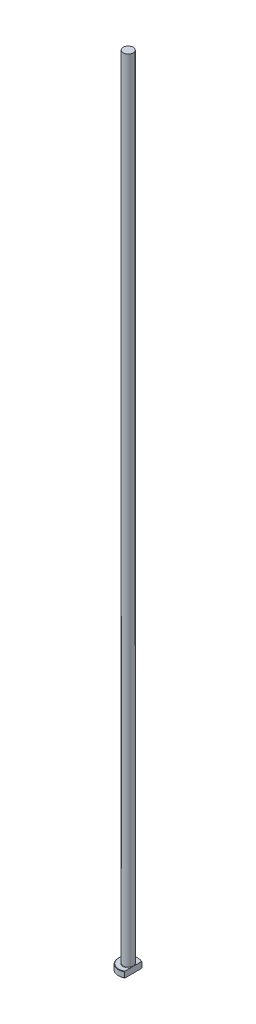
ISO-10303-21;
HEADER;
FILE_DESCRIPTION(('STEP AP214'),'2;1');
FILE_NAME('part.step','',(''),(''),'','','');
FILE_SCHEMA(('AUTOMOTIVE_DESIGN { 1 0 10303 214 1 1 1 1 }'));
ENDSEC;
DATA;
#1=APPLICATION_CONTEXT('core data for automotive mechanical design processes');
#2=APPLICATION_PROTOCOL_DEFINITION('international standard','automotive_design',2000,#1);
#3=PRODUCT_CONTEXT('',#1,'mechanical');
#4=PRODUCT('Part','Part','',(#3));
#5=PRODUCT_RELATED_PRODUCT_CATEGORY('part','',(#4));
#6=PRODUCT_DEFINITION_FORMATION('','',#4);
#7=PRODUCT_DEFINITION_CONTEXT('part definition',#1,'design');
#8=PRODUCT_DEFINITION('design','',#6,#7);
#9=PRODUCT_DEFINITION_SHAPE('','',#8);
#10=(LENGTH_UNIT() NAMED_UNIT(*) SI_UNIT(.MILLI.,.METRE.));
#11=(NAMED_UNIT(*) PLANE_ANGLE_UNIT() SI_UNIT($,.RADIAN.));
#12=(NAMED_UNIT(*) SI_UNIT($,.STERADIAN.) SOLID_ANGLE_UNIT());
#13=UNCERTAINTY_MEASURE_WITH_UNIT(LENGTH_MEASURE(1.E-05),#10,'distance_accuracy_value','');
#14=(GEOMETRIC_REPRESENTATION_CONTEXT(3) GLOBAL_UNCERTAINTY_ASSIGNED_CONTEXT((#13)) GLOBAL_UNIT_ASSIGNED_CONTEXT((#10,
#11,#12)) REPRESENTATION_CONTEXT('',''));
#15=CARTESIAN_POINT('',(0.,0.,0.));
#16=DIRECTION('',(0.,0.,1.));
#17=DIRECTION('',(1.,0.,0.));
#18=AXIS2_PLACEMENT_3D('',#15,#16,#17);
#19=CARTESIAN_POINT('',(0.,0.,0.));
#20=DIRECTION('',(0.,-1.,0.));
#21=DIRECTION('',(0.,0.,-1.));
#22=AXIS2_PLACEMENT_3D('',#19,#20,#21);
#23=PLANE('',#22);
#24=CARTESIAN_POINT('',(0.,0.,0.));
#25=DIRECTION('',(0.,-1.,0.));
#26=DIRECTION('',(0.,0.,-1.));
#27=AXIS2_PLACEMENT_3D('',#24,#25,#26);
#28=CIRCLE('',#27,4.79999999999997);
#29=CARTESIAN_POINT('',(2.49999999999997,0.,4.09756024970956));
#30=VERTEX_POINT('',#29);
#31=CARTESIAN_POINT('',(2.49999999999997,0.,-4.09756024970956));
#32=VERTEX_POINT('',#31);
#33=EDGE_CURVE('E98',#30,#32,#28,.T.);
#34=ORIENTED_EDGE('',*,*,#33,.T.);
#35=DIRECTION('',(0.,0.,1.));
#36=VECTOR('',#35,1.);
#37=CARTESIAN_POINT('',(2.49999999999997,0.,-4.33012701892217));
#38=LINE('',#37,#36);
#39=EDGE_CURVE('E83',#32,#30,#38,.T.);
#40=ORIENTED_EDGE('',*,*,#39,.T.);
#41=EDGE_LOOP('',(#34,#40));
#42=FACE_BOUND('',#41,.T.);
#43=ADVANCED_FACE('F32',(#42),#23,.T.);
#44=CARTESIAN_POINT('',(0.,259.958771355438,0.));
#45=DIRECTION('',(0.,1.,0.));
#46=DIRECTION('',(0.,0.,1.));
#47=AXIS2_PLACEMENT_3D('',#44,#45,#46);
#48=CYLINDRICAL_SURFACE('',#47,4.99999999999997);
#49=CARTESIAN_POINT('',(0.,2.80000000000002,0.));
#50=DIRECTION('',(0.,1.,0.));
#51=DIRECTION('',(0.,0.,1.));
#52=AXIS2_PLACEMENT_3D('',#49,#50,#51);
#53=CIRCLE('',#52,4.99999999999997);
#54=CARTESIAN_POINT('',(2.49999999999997,2.80000000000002,4.33012701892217));
#55=VERTEX_POINT('',#54);
#56=CARTESIAN_POINT('',(2.49999999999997,2.80000000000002,-4.33012701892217));
#57=VERTEX_POINT('',#56);
#58=EDGE_CURVE('E104',#55,#57,#53,.F.);
#59=ORIENTED_EDGE('',*,*,#58,.T.);
#60=DIRECTION('',(0.,-1.,0.));
#61=VECTOR('',#60,1.);
#62=CARTESIAN_POINT('',(2.49999999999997,400.,-4.33012701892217));
#63=LINE('',#62,#61);
#64=CARTESIAN_POINT('',(2.49999999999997,0.199999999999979,-4.33012701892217));
#65=VERTEX_POINT('',#64);
#66=EDGE_CURVE('E183',#57,#65,#63,.T.);
#67=ORIENTED_EDGE('',*,*,#66,.T.);
#68=CARTESIAN_POINT('',(0.,0.199999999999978,0.));
#69=DIRECTION('',(0.,-1.,0.));
#70=DIRECTION('',(0.,0.,-1.));
#71=AXIS2_PLACEMENT_3D('',#68,#69,#70);
#72=CIRCLE('',#71,4.99999999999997);
#73=CARTESIAN_POINT('',(2.49999999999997,0.199999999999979,4.33012701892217));
#74=VERTEX_POINT('',#73);
#75=EDGE_CURVE('E100',#65,#74,#72,.F.);
#76=ORIENTED_EDGE('',*,*,#75,.T.);
#77=DIRECTION('',(0.,-1.,0.));
#78=VECTOR('',#77,1.);
#79=CARTESIAN_POINT('',(2.49999999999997,400.,4.33012701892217));
#80=LINE('',#79,#78);
#81=EDGE_CURVE('E93',#55,#74,#80,.T.);
#82=ORIENTED_EDGE('',*,*,#81,.F.);
#83=EDGE_LOOP('',(#59,#67,#76,#82));
#84=FACE_BOUND('',#83,.T.);
#85=ADVANCED_FACE('F158',(#84),#48,.T.);
#86=CARTESIAN_POINT('',(-4.99999999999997,3.,0.));
#87=DIRECTION('',(0.,1.,0.));
#88=DIRECTION('',(0.,0.,1.));
#89=AXIS2_PLACEMENT_3D('',#86,#87,#88);
#90=PLANE('',#89);
#91=CARTESIAN_POINT('',(0.,3.,0.));
#92=DIRECTION('',(0.,1.,0.));
#93=DIRECTION('',(0.,0.,1.));
#94=AXIS2_PLACEMENT_3D('',#91,#92,#93);
#95=CIRCLE('',#94,4.79999999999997);
#96=CARTESIAN_POINT('',(2.49999999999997,3.,-4.09756024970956));
#97=VERTEX_POINT('',#96);
#98=CARTESIAN_POINT('',(2.49999999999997,3.,4.09756024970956));
#99=VERTEX_POINT('',#98);
#100=EDGE_CURVE('E178',#97,#99,#95,.T.);
#101=ORIENTED_EDGE('',*,*,#100,.T.);
#102=DIRECTION('',(0.,0.,-1.));
#103=VECTOR('',#102,1.);
#104=CARTESIAN_POINT('',(2.49999999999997,3.,0.));
#105=LINE('',#104,#103);
#106=CARTESIAN_POINT('',(2.49999999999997,2.99999999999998,1.01980390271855));
#107=VERTEX_POINT('',#106);
#108=EDGE_CURVE('E57',#99,#107,#105,.T.);
#109=ORIENTED_EDGE('',*,*,#108,.T.);
#110=CARTESIAN_POINT('',(0.,3.,0.));
#111=DIRECTION('',(0.,1.,0.));
#112=DIRECTION('',(0.,0.,1.));
#113=AXIS2_PLACEMENT_3D('',#110,#111,#112);
#114=CIRCLE('',#113,2.69999999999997);
#115=CARTESIAN_POINT('',(2.49999999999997,2.99999999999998,-1.01980390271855));
#116=VERTEX_POINT('',#115);
#117=EDGE_CURVE('E107',#107,#116,#114,.F.);
#118=ORIENTED_EDGE('',*,*,#117,.T.);
#119=EDGE_CURVE('E136',#116,#97,#105,.T.);
#120=ORIENTED_EDGE('',*,*,#119,.T.);
#121=EDGE_LOOP('',(#101,#109,#118,#120));
#122=FACE_BOUND('',#121,.T.);
#123=ADVANCED_FACE('F147',(#122),#90,.T.);
#124=CARTESIAN_POINT('',(0.,3.,0.));
#125=DIRECTION('',(0.,-1.,0.));
#126=DIRECTION('',(0.,0.,-1.));
#127=AXIS2_PLACEMENT_3D('',#124,#125,#126);
#128=CONICAL_SURFACE('',#127,4.79999999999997,0.785398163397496);
#129=ORIENTED_EDGE('',*,*,#58,.F.);
#130=CARTESIAN_POINT('',(2.49999999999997,-2.05039133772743,9.52786489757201));
#131=CARTESIAN_POINT('',(2.49999999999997,-1.84160367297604,9.31199733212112));
#132=CARTESIAN_POINT('',(2.49999999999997,-1.63304008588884,9.09591231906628));
#133=CARTESIAN_POINT('',(2.49999999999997,-1.21649358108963,8.66317810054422));
#134=CARTESIAN_POINT('',(2.49999999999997,-1.00851067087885,8.44652888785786));
#135=CARTESIAN_POINT('',(2.49999999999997,-0.593157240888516,8.01243155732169));
#136=CARTESIAN_POINT('',(2.49999999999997,-0.385787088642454,7.79498308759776));
#137=CARTESIAN_POINT('',(2.49999999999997,0.0280365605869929,7.3592177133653));
#138=CARTESIAN_POINT('',(2.49999999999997,0.234490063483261,7.14090081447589));
#139=CARTESIAN_POINT('',(2.49999999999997,0.642130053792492,6.70748960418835));
#140=CARTESIAN_POINT('',(2.49999999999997,0.843339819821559,6.49241720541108));
#141=CARTESIAN_POINT('',(2.49999999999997,1.24425381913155,6.06087422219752));
#142=CARTESIAN_POINT('',(2.49999999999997,1.44395806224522,5.84440364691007));
#143=CARTESIAN_POINT('',(2.49999999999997,1.8412775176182,5.40963663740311));
#144=CARTESIAN_POINT('',(2.49999999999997,2.03889317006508,5.19134060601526));
#145=CARTESIAN_POINT('',(2.49999999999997,2.43125043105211,4.75218509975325));
#146=CARTESIAN_POINT('',(2.49999999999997,2.62599215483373,4.53132572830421));
#147=CARTESIAN_POINT('',(2.49999999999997,2.93693788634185,4.17181619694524));
#148=CARTESIAN_POINT('',(2.49999999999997,3.05446493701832,4.03431188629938));
#149=CARTESIAN_POINT('',(2.49999999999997,3.28742704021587,3.75751486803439));
#150=CARTESIAN_POINT('',(2.49999999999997,3.4028618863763,3.618221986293));
#151=CARTESIAN_POINT('',(2.49999999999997,3.63213234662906,3.33586492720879));
#152=CARTESIAN_POINT('',(2.49999999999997,3.74593818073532,3.1927764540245));
#153=CARTESIAN_POINT('',(2.49999999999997,3.9695626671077,2.90356071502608));
#154=CARTESIAN_POINT('',(2.49999999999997,4.07938227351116,2.75743418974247));
#155=CARTESIAN_POINT('',(2.49999999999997,4.29502410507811,2.45881038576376));
#156=CARTESIAN_POINT('',(2.49999999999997,4.4007603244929,2.30625006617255));
#157=CARTESIAN_POINT('',(2.49999999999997,4.55286945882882,2.07299325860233));
#158=CARTESIAN_POINT('',(2.49999999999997,4.60252613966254,1.99444197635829));
#159=CARTESIAN_POINT('',(2.49999999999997,4.69908164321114,1.83566827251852));
#160=CARTESIAN_POINT('',(2.49999999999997,4.74598077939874,1.75544604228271));
#161=CARTESIAN_POINT('',(2.49999999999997,4.8357846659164,1.59405362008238));
#162=CARTESIAN_POINT('',(2.49999999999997,4.87873126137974,1.5129070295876));
#163=CARTESIAN_POINT('',(2.49999999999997,4.96038600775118,1.34852090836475));
#164=CARTESIAN_POINT('',(2.49999999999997,4.99909338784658,1.26528100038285));
#165=CARTESIAN_POINT('',(2.49999999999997,5.10703093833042,1.01251774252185));
#166=CARTESIAN_POINT('',(2.49999999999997,5.16843307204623,0.83934206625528));
#167=CARTESIAN_POINT('',(2.49999999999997,5.23490554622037,0.579703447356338));
#168=CARTESIAN_POINT('',(2.49999999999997,5.25253806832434,0.496421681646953));
#169=CARTESIAN_POINT('',(2.49999999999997,5.27986337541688,0.328535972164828));
#170=CARTESIAN_POINT('',(2.49999999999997,5.28955686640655,0.243932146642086));
#171=CARTESIAN_POINT('',(2.49999999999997,5.30031768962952,0.074434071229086));
#172=CARTESIAN_POINT('',(2.49999999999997,5.30141176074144,-0.0104584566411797));
#173=CARTESIAN_POINT('',(2.49999999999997,5.29496530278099,-0.179916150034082));
#174=CARTESIAN_POINT('',(2.49999999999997,5.28742406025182,-0.264481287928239));
#175=CARTESIAN_POINT('',(2.49999999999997,5.26433424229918,-0.431754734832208));
#176=CARTESIAN_POINT('',(2.49999999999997,5.24885436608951,-0.514472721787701));
#177=CARTESIAN_POINT('',(2.49999999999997,5.21085318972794,-0.678257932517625));
#178=CARTESIAN_POINT('',(2.49999999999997,5.18833104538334,-0.759324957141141));
#179=CARTESIAN_POINT('',(2.49999999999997,5.13718929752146,-0.920001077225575));
#180=CARTESIAN_POINT('',(2.49999999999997,5.10853534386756,-0.99959909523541));
#181=CARTESIAN_POINT('',(2.49999999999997,5.04628092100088,-1.15679278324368));
#182=CARTESIAN_POINT('',(2.49999999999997,5.01268146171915,-1.23438885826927));
#183=CARTESIAN_POINT('',(2.49999999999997,4.90558195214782,-1.46503672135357));
#184=CARTESIAN_POINT('',(2.49999999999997,4.82601567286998,-1.61526350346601));
#185=CARTESIAN_POINT('',(2.49999999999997,4.6563523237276,-1.90970759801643));
#186=CARTESIAN_POINT('',(2.49999999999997,4.56624199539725,-2.05391702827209));
#187=CARTESIAN_POINT('',(2.49999999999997,4.37862201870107,-2.33821627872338));
#188=CARTESIAN_POINT('',(2.49999999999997,4.28108460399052,-2.478287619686));
#189=CARTESIAN_POINT('',(2.49999999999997,4.0811627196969,-2.75478641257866));
#190=CARTESIAN_POINT('',(2.49999999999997,3.97878070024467,-2.89121565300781));
#191=CARTESIAN_POINT('',(2.49999999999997,3.76913910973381,-3.16313520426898));
#192=CARTESIAN_POINT('',(2.49999999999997,3.66183307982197,-3.29858952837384));
#193=CARTESIAN_POINT('',(2.49999999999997,3.44456217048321,-3.56736427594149));
#194=CARTESIAN_POINT('',(2.49999999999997,3.3345970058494,-3.7006844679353));
#195=CARTESIAN_POINT('',(2.49999999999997,3.11293465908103,-3.96532340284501));
#196=CARTESIAN_POINT('',(2.49999999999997,3.00124232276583,-4.09664621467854));
#197=CARTESIAN_POINT('',(2.49999999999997,2.77631276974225,-4.35796341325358));
#198=CARTESIAN_POINT('',(2.49999999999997,2.66307552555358,-4.48795777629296));
#199=CARTESIAN_POINT('',(2.49999999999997,2.36028773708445,-4.83228553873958));
#200=CARTESIAN_POINT('',(2.49999999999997,2.16967435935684,-5.04568363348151));
#201=CARTESIAN_POINT('',(2.49999999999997,1.78611780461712,-5.47037913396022));
#202=CARTESIAN_POINT('',(2.49999999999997,1.59317456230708,-5.68167648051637));
#203=CARTESIAN_POINT('',(2.49999999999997,1.20540648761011,-6.10290357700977));
#204=CARTESIAN_POINT('',(2.49999999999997,1.01058005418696,-6.31283185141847));
#205=CARTESIAN_POINT('',(2.49999999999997,0.619649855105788,-6.73149551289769));
#206=CARTESIAN_POINT('',(2.49999999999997,0.423546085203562,-6.94023089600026));
#207=CARTESIAN_POINT('',(2.49999999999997,0.0384434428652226,-7.34820392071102));
#208=CARTESIAN_POINT('',(2.49999999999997,-0.150515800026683,-7.54747899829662));
#209=CARTESIAN_POINT('',(2.49999999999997,-0.529153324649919,-7.94534601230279));
#210=CARTESIAN_POINT('',(2.49999999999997,-0.718831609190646,-8.14393794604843));
#211=CARTESIAN_POINT('',(2.49999999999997,-1.0985546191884,-8.54034636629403));
#212=CARTESIAN_POINT('',(2.49999999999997,-1.2885986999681,-8.73816347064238));
#213=CARTESIAN_POINT('',(2.49999999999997,-1.66916268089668,-9.13333639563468));
#214=CARTESIAN_POINT('',(2.49999999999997,-1.85968257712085,-9.33069222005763));
#215=CARTESIAN_POINT('',(2.49999999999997,-2.05039133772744,-9.52786489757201));
#216=B_SPLINE_CURVE_WITH_KNOTS('',3,(#130,#131,#132,#133,#134,#135,#136,#137,#138,#139,#140,
#141,#142,#143,#144,#145,#146,#147,#148,#149,#150,#151,#152,#153,#154,#155,#156,#157,#158,#159,
#160,#161,#162,#163,#164,#165,#166,#167,#168,#169,#170,#171,#172,#173,#174,#175,#176,#177,#178,
#179,#180,#181,#182,#183,#184,#185,#186,#187,#188,#189,#190,#191,#192,#193,#194,#195,#196,#197,
#198,#199,#200,#201,#202,#203,#204,#205,#206,#207,#208,#209,#210,#211,#212,#213,#214,#215),
.UNSPECIFIED.,.F.,.F.,(4,2,2,2,2,2,2,2,2,2,2,2,2,2,2,2,2,2,2,2,2,2,2,2,2,2,2,2,2,2,2,2,2,2,2,2,
2,2,2,2,2,2,4),(0.,0.900955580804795,1.8019227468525,2.70335062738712,3.60477268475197,
4.48832484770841,5.37187123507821,6.25522753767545,7.13854832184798,7.68119321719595,
8.22389134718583,8.77232299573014,9.32062249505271,9.87724663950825,10.1559936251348,
10.4347088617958,10.7100145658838,10.9853702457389,11.5339745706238,11.7890461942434,
12.0440951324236,12.2983507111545,12.5526272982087,12.8047396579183,13.0568822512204,
13.310476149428,13.5640183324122,14.0732618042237,14.5831526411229,15.0950533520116,
15.6066978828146,16.1250759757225,16.643509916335,17.1606868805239,17.6778730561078,
18.5362451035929,19.3946412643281,20.2538459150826,21.113053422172,21.9369112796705,
22.7607723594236,23.583714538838,24.4066499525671),.UNSPECIFIED.);
#217=EDGE_CURVE('E135',#55,#99,#216,.T.);
#218=ORIENTED_EDGE('',*,*,#217,.T.);
#219=ORIENTED_EDGE('',*,*,#100,.F.);
#220=EDGE_CURVE('E127',#97,#57,#216,.T.);
#221=ORIENTED_EDGE('',*,*,#220,.T.);
#222=EDGE_LOOP('',(#129,#218,#219,#221));
#223=FACE_BOUND('',#222,.T.);
#224=ADVANCED_FACE('F143',(#223),#128,.T.);
#225=CARTESIAN_POINT('',(0.,0.199999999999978,0.));
#226=DIRECTION('',(0.,1.,0.));
#227=DIRECTION('',(0.,0.,1.));
#228=AXIS2_PLACEMENT_3D('',#225,#226,#227);
#229=CONICAL_SURFACE('',#228,4.99999999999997,0.785398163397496);
#230=ORIENTED_EDGE('',*,*,#75,.F.);
#231=CARTESIAN_POINT('',(2.49999999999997,5.05039133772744,-9.52786489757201));
#232=CARTESIAN_POINT('',(2.49999999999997,4.84160367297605,-9.31199733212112));
#233=CARTESIAN_POINT('',(2.49999999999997,4.63304008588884,-9.09591231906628));
#234=CARTESIAN_POINT('',(2.49999999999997,4.21649358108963,-8.66317810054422));
#235=CARTESIAN_POINT('',(2.49999999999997,4.00851067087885,-8.44652888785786));
#236=CARTESIAN_POINT('',(2.49999999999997,3.59315724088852,-8.01243155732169));
#237=CARTESIAN_POINT('',(2.49999999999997,3.38578708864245,-7.79498308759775));
#238=CARTESIAN_POINT('',(2.49999999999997,2.97196343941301,-7.35921771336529));
#239=CARTESIAN_POINT('',(2.49999999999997,2.76550993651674,-7.14090081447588));
#240=CARTESIAN_POINT('',(2.49999999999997,2.35786994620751,-6.70748960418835));
#241=CARTESIAN_POINT('',(2.49999999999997,2.15666018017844,-6.49241720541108));
#242=CARTESIAN_POINT('',(2.49999999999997,1.75574618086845,-6.06087422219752));
#243=CARTESIAN_POINT('',(2.49999999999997,1.55604193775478,-5.84440364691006));
#244=CARTESIAN_POINT('',(2.49999999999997,1.1587224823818,-5.40963663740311));
#245=CARTESIAN_POINT('',(2.49999999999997,0.961106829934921,-5.19134060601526));
#246=CARTESIAN_POINT('',(2.49999999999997,0.568749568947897,-4.75218509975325));
#247=CARTESIAN_POINT('',(2.49999999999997,0.374007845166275,-4.53132572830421));
#248=CARTESIAN_POINT('',(2.49999999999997,0.0630621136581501,-4.17181619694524));
#249=CARTESIAN_POINT('',(2.49999999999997,-0.0544649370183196,-4.03431188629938));
#250=CARTESIAN_POINT('',(2.49999999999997,-0.287427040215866,-3.75751486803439));
#251=CARTESIAN_POINT('',(2.49999999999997,-0.402861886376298,-3.618221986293));
#252=CARTESIAN_POINT('',(2.49999999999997,-0.632132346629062,-3.33586492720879));
#253=CARTESIAN_POINT('',(2.49999999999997,-0.745938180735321,-3.1927764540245));
#254=CARTESIAN_POINT('',(2.49999999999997,-0.969562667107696,-2.90356071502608));
#255=CARTESIAN_POINT('',(2.49999999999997,-1.07938227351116,-2.75743418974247));
#256=CARTESIAN_POINT('',(2.49999999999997,-1.29502410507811,-2.45881038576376));
#257=CARTESIAN_POINT('',(2.49999999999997,-1.4007603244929,-2.30625006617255));
#258=CARTESIAN_POINT('',(2.49999999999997,-1.55286945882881,-2.07299325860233));
#259=CARTESIAN_POINT('',(2.49999999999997,-1.60252613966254,-1.99444197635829));
#260=CARTESIAN_POINT('',(2.49999999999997,-1.69908164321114,-1.83566827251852));
#261=CARTESIAN_POINT('',(2.49999999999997,-1.74598077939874,-1.75544604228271));
#262=CARTESIAN_POINT('',(2.49999999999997,-1.83578466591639,-1.59405362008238));
#263=CARTESIAN_POINT('',(2.49999999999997,-1.87873126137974,-1.5129070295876));
#264=CARTESIAN_POINT('',(2.49999999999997,-1.96038600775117,-1.34852090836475));
#265=CARTESIAN_POINT('',(2.49999999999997,-1.99909338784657,-1.26528100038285));
#266=CARTESIAN_POINT('',(2.49999999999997,-2.10703093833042,-1.01251774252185));
#267=CARTESIAN_POINT('',(2.49999999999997,-2.16843307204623,-0.839342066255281));
#268=CARTESIAN_POINT('',(2.49999999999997,-2.23490554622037,-0.579703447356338));
#269=CARTESIAN_POINT('',(2.49999999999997,-2.25253806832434,-0.496421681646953));
#270=CARTESIAN_POINT('',(2.49999999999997,-2.27986337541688,-0.328535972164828));
#271=CARTESIAN_POINT('',(2.49999999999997,-2.28955686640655,-0.243932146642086));
#272=CARTESIAN_POINT('',(2.49999999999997,-2.30031768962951,-0.0744340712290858));
#273=CARTESIAN_POINT('',(2.49999999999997,-2.30141176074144,0.01045845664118));
#274=CARTESIAN_POINT('',(2.49999999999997,-2.29496530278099,0.179916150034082));
#275=CARTESIAN_POINT('',(2.49999999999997,-2.28742406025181,0.26448128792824));
#276=CARTESIAN_POINT('',(2.49999999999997,-2.26433424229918,0.431754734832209));
#277=CARTESIAN_POINT('',(2.49999999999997,-2.24885436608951,0.514472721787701));
#278=CARTESIAN_POINT('',(2.49999999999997,-2.21085318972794,0.678257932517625));
#279=CARTESIAN_POINT('',(2.49999999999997,-2.18833104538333,0.759324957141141));
#280=CARTESIAN_POINT('',(2.49999999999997,-2.13718929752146,0.920001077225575));
#281=CARTESIAN_POINT('',(2.49999999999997,-2.10853534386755,0.999599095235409));
#282=CARTESIAN_POINT('',(2.49999999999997,-2.04628092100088,1.15679278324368));
#283=CARTESIAN_POINT('',(2.49999999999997,-2.01268146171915,1.23438885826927));
#284=CARTESIAN_POINT('',(2.49999999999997,-1.90558195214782,1.46503672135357));
#285=CARTESIAN_POINT('',(2.49999999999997,-1.82601567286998,1.61526350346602));
#286=CARTESIAN_POINT('',(2.49999999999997,-1.6563523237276,1.90970759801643));
#287=CARTESIAN_POINT('',(2.49999999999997,-1.56624199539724,2.05391702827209));
#288=CARTESIAN_POINT('',(2.49999999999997,-1.37862201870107,2.33821627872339));
#289=CARTESIAN_POINT('',(2.49999999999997,-1.28108460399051,2.478287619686));
#290=CARTESIAN_POINT('',(2.49999999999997,-1.08116271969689,2.75478641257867));
#291=CARTESIAN_POINT('',(2.49999999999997,-0.978780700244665,2.89121565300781));
#292=CARTESIAN_POINT('',(2.49999999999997,-0.7691391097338,3.16313520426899));
#293=CARTESIAN_POINT('',(2.49999999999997,-0.66183307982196,3.29858952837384));
#294=CARTESIAN_POINT('',(2.49999999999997,-0.444562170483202,3.56736427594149));
#295=CARTESIAN_POINT('',(2.49999999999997,-0.33459700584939,3.7006844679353));
#296=CARTESIAN_POINT('',(2.49999999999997,-0.112934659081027,3.96532340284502));
#297=CARTESIAN_POINT('',(2.49999999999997,-0.00124232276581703,4.09664621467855));
#298=CARTESIAN_POINT('',(2.49999999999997,0.223687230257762,4.35796341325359));
#299=CARTESIAN_POINT('',(2.49999999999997,0.336924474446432,4.48795777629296));
#300=CARTESIAN_POINT('',(2.49999999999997,0.639712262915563,4.83228553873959));
#301=CARTESIAN_POINT('',(2.49999999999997,0.83032564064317,5.04568363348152));
#302=CARTESIAN_POINT('',(2.49999999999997,1.21388219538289,5.47037913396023));
#303=CARTESIAN_POINT('',(2.49999999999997,1.40682543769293,5.68167648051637));
#304=CARTESIAN_POINT('',(2.49999999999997,1.7945935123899,6.10290357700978));
#305=CARTESIAN_POINT('',(2.49999999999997,1.98941994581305,6.31283185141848));
#306=CARTESIAN_POINT('',(2.49999999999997,2.38035014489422,6.73149551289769));
#307=CARTESIAN_POINT('',(2.49999999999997,2.57645391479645,6.94023089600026));
#308=CARTESIAN_POINT('',(2.49999999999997,2.96155655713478,7.34820392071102));
#309=CARTESIAN_POINT('',(2.49999999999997,3.15051580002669,7.54747899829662));
#310=CARTESIAN_POINT('',(2.49999999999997,3.52915332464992,7.9453460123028));
#311=CARTESIAN_POINT('',(2.49999999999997,3.71883160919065,8.14393794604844));
#312=CARTESIAN_POINT('',(2.49999999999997,4.0985546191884,8.54034636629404));
#313=CARTESIAN_POINT('',(2.49999999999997,4.2885986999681,8.73816347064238));
#314=CARTESIAN_POINT('',(2.49999999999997,4.66916268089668,9.13333639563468));
#315=CARTESIAN_POINT('',(2.49999999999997,4.85968257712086,9.33069222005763));
#316=CARTESIAN_POINT('',(2.49999999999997,5.05039133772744,9.52786489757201));
#317=B_SPLINE_CURVE_WITH_KNOTS('',3,(#231,#232,#233,#234,#235,#236,#237,#238,#239,#240,#241,
#242,#243,#244,#245,#246,#247,#248,#249,#250,#251,#252,#253,#254,#255,#256,#257,#258,#259,#260,
#261,#262,#263,#264,#265,#266,#267,#268,#269,#270,#271,#272,#273,#274,#275,#276,#277,#278,#279,
#280,#281,#282,#283,#284,#285,#286,#287,#288,#289,#290,#291,#292,#293,#294,#295,#296,#297,#298,
#299,#300,#301,#302,#303,#304,#305,#306,#307,#308,#309,#310,#311,#312,#313,#314,#315,#316),
.UNSPECIFIED.,.F.,.F.,(4,2,2,2,2,2,2,2,2,2,2,2,2,2,2,2,2,2,2,2,2,2,2,2,2,2,2,2,2,2,2,2,2,2,2,2,
2,2,2,2,2,2,4),(0.,0.900955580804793,1.8019227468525,2.70335062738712,3.60477268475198,
4.48832484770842,5.37187123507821,6.25522753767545,7.13854832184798,7.68119321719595,
8.22389134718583,8.77232299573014,9.32062249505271,9.87724663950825,10.1559936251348,
10.4347088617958,10.7100145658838,10.9853702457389,11.5339745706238,11.7890461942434,
12.0440951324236,12.2983507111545,12.5526272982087,12.8047396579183,13.0568822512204,
13.310476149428,13.5640183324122,14.0732618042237,14.5831526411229,15.0950533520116,
15.6066978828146,16.1250759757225,16.643509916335,17.1606868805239,17.6778730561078,
18.5362451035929,19.3946412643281,20.2538459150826,21.113053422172,21.9369112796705,
22.7607723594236,23.583714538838,24.4066499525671),.UNSPECIFIED.);
#318=EDGE_CURVE('E86',#65,#32,#317,.T.);
#319=ORIENTED_EDGE('',*,*,#318,.T.);
#320=ORIENTED_EDGE('',*,*,#33,.F.);
#321=EDGE_CURVE('E89',#30,#74,#317,.T.);
#322=ORIENTED_EDGE('',*,*,#321,.T.);
#323=EDGE_LOOP('',(#230,#319,#320,#322));
#324=FACE_BOUND('',#323,.T.);
#325=ADVANCED_FACE('F97',(#324),#229,.T.);
#326=CARTESIAN_POINT('',(0.,3.19999999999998,0.));
#327=DIRECTION('',(0.,1.,0.));
#328=DIRECTION('',(0.,0.,1.));
#329=AXIS2_PLACEMENT_3D('',#326,#327,#328);
#330=TOROIDAL_SURFACE('',#329,2.69999999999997,0.2);
#331=CARTESIAN_POINT('',(2.49999999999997,3.19999999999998,0.));
#332=CARTESIAN_POINT('',(2.49999999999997,3.20000050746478,5.29061312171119E-11));
#333=CARTESIAN_POINT('',(2.49999999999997,3.20000101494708,-1.70517157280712E-07));
#334=CARTESIAN_POINT('',(2.49999999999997,3.20000196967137,-6.59443804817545E-07));
#335=CARTESIAN_POINT('',(2.49999999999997,3.20000240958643,-9.87883924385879E-07));
#336=CARTESIAN_POINT('',(2.49999999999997,3.20000331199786,-1.7724689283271E-06));
#337=CARTESIAN_POINT('',(2.49999999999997,3.20000376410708,-2.24097229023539E-06));
#338=CARTESIAN_POINT('',(2.49999999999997,3.20000458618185,-3.2218605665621E-06));
#339=CARTESIAN_POINT('',(2.49999999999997,3.20000495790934,-3.73286586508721E-06));
#340=CARTESIAN_POINT('',(2.49999999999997,3.20000630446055,-5.67453781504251E-06));
#341=CARTESIAN_POINT('',(2.49999999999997,3.20000720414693,-7.15943624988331E-06));
#342=CARTESIAN_POINT('',(2.49999999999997,3.20000871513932,-1.01304383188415E-05));
#343=CARTESIAN_POINT('',(2.49999999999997,3.20000934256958,-1.16087237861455E-05));
#344=CARTESIAN_POINT('',(2.49999999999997,3.20001191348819,-1.77555555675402E-05));
#345=CARTESIAN_POINT('',(2.49999999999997,3.20001378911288,-2.24564506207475E-05));
#346=CARTESIAN_POINT('',(2.49999999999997,3.20001661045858,-3.14167101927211E-05));
#347=CARTESIAN_POINT('',(2.49999999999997,3.20001764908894,-3.56468503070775E-05));
#348=CARTESIAN_POINT('',(2.49999999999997,3.20002511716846,-6.67543462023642E-05));
#349=CARTESIAN_POINT('',(2.49999999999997,3.20003067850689,-9.37930225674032E-05));
#350=CARTESIAN_POINT('',(2.49999999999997,3.20005501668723,-0.000200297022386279));
#351=CARTESIAN_POINT('',(2.49999999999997,3.20007833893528,-0.000278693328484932));
#352=CARTESIAN_POINT('',(2.49999999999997,3.20016883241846,-0.000588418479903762));
#353=CARTESIAN_POINT('',(2.49999999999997,3.2002329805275,-0.000820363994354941));
#354=CARTESIAN_POINT('',(2.49999999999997,3.20048923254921,-0.00173961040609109));
#355=CARTESIAN_POINT('',(2.49999999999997,3.20068508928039,-0.00242612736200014));
#356=CARTESIAN_POINT('',(2.49999999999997,3.201497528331,-0.00528196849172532));
#357=CARTESIAN_POINT('',(2.49999999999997,3.20210941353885,-0.0074522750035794));
#358=CARTESIAN_POINT('',(2.49999999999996,3.20774599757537,-0.0274346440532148));
#359=CARTESIAN_POINT('',(2.49999999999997,3.21279017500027,-0.0452427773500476));
#360=CARTESIAN_POINT('',(2.49999999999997,3.22264347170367,-0.080167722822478));
#361=CARTESIAN_POINT('',(2.49999999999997,3.22745402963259,-0.0972841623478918));
#362=CARTESIAN_POINT('',(2.49999999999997,3.23763483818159,-0.133672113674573));
#363=CARTESIAN_POINT('',(2.49999999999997,3.24299975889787,-0.15294514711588));
#364=CARTESIAN_POINT('',(2.49999999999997,3.25370389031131,-0.191722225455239));
#365=CARTESIAN_POINT('',(2.49999999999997,3.25904219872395,-0.211226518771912));
#366=CARTESIAN_POINT('',(2.49999999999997,3.27184445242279,-0.258540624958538));
#367=CARTESIAN_POINT('',(2.49999999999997,3.27925018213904,-0.286366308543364));
#368=CARTESIAN_POINT('',(2.49999999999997,3.29355148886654,-0.341371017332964));
#369=CARTESIAN_POINT('',(2.49999999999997,3.30045534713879,-0.368547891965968));
#370=CARTESIAN_POINT('',(2.49999999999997,3.31991129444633,-0.447507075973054));
#371=CARTESIAN_POINT('',(2.49999999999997,3.33195369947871,-0.499417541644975));
#372=CARTESIAN_POINT('',(2.49999999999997,3.35404241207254,-0.60418810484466));
#373=CARTESIAN_POINT('',(2.49999999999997,3.36406867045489,-0.657052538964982));
#374=CARTESIAN_POINT('',(2.49999999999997,3.38176575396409,-0.767598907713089));
#375=CARTESIAN_POINT('',(2.49999999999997,3.38917909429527,-0.825323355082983));
#376=CARTESIAN_POINT('',(2.49999999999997,3.39884096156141,-0.94105511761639));
#377=CARTESIAN_POINT('',(2.49999999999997,3.40111055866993,-0.999060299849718));
#378=CARTESIAN_POINT('',(2.49999999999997,3.39847691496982,-1.09324578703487));
#379=CARTESIAN_POINT('',(2.49999999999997,3.39593644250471,-1.12948454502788));
#380=CARTESIAN_POINT('',(2.49999999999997,3.38674319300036,-1.20096926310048));
#381=CARTESIAN_POINT('',(2.49999999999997,3.38015410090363,-1.2362219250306));
#382=CARTESIAN_POINT('',(2.49999999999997,3.36639936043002,-1.28579148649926));
#383=CARTESIAN_POINT('',(2.49999999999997,3.36162670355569,-1.30076836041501));
#384=CARTESIAN_POINT('',(2.49999999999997,3.35062798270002,-1.33028325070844));
#385=CARTESIAN_POINT('',(2.49999999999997,3.34439458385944,-1.34481861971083));
#386=CARTESIAN_POINT('',(2.49999999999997,3.33003808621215,-1.37319413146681));
#387=CARTESIAN_POINT('',(2.49999999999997,3.32189015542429,-1.38702194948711));
#388=CARTESIAN_POINT('',(2.49999999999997,3.30325367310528,-1.4129811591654));
#389=CARTESIAN_POINT('',(2.49999999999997,3.2927824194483,-1.42512406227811));
#390=CARTESIAN_POINT('',(2.49999999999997,3.27569207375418,-1.44029611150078));
#391=CARTESIAN_POINT('',(2.49999999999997,3.27021837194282,-1.4446101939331));
#392=CARTESIAN_POINT('',(2.49999999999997,3.25870897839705,-1.45242709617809));
#393=CARTESIAN_POINT('',(2.49999999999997,3.25267333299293,-1.45592998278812));
#394=CARTESIAN_POINT('',(2.49999999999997,3.24001938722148,-1.46191450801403));
#395=CARTESIAN_POINT('',(2.49999999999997,3.233395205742,-1.46438399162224));
#396=CARTESIAN_POINT('',(2.49999999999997,3.21979347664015,-1.46798853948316));
#397=CARTESIAN_POINT('',(2.49999999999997,3.21281651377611,-1.46912574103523));
#398=CARTESIAN_POINT('',(2.49999999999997,3.19961348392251,-1.46988240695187));
#399=CARTESIAN_POINT('',(2.49999999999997,3.19339654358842,-1.46966594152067));
#400=CARTESIAN_POINT('',(2.49999999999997,3.18110362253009,-1.46811597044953));
#401=CARTESIAN_POINT('',(2.49999999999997,3.17502769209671,-1.46678207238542));
#402=CARTESIAN_POINT('',(2.49999999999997,3.16354702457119,-1.46323301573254));
#403=CARTESIAN_POINT('',(2.49999999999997,3.15812390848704,-1.46107586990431));
#404=CARTESIAN_POINT('',(2.49999999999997,3.14763458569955,-1.45603007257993));
#405=CARTESIAN_POINT('',(2.49999999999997,3.14256845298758,-1.45314127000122));
#406=CARTESIAN_POINT('',(2.49999999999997,3.12963191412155,-1.44468844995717));
#407=CARTESIAN_POINT('',(2.49999999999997,3.12209714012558,-1.43861122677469));
#408=CARTESIAN_POINT('',(2.49999999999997,3.10805350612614,-1.42536327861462));
#409=CARTESIAN_POINT('',(2.49999999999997,3.10154826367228,-1.418188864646));
#410=CARTESIAN_POINT('',(2.49999999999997,3.08513615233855,-1.39772885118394));
#411=CARTESIAN_POINT('',(2.49999999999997,3.07611692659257,-1.38373739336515));
#412=CARTESIAN_POINT('',(2.49999999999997,3.06018433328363,-1.35465370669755));
#413=CARTESIAN_POINT('',(2.49999999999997,3.0532724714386,-1.33956070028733));
#414=CARTESIAN_POINT('',(2.49999999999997,3.04107204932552,-1.30868385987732));
#415=CARTESIAN_POINT('',(2.49999999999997,3.03578911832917,-1.29289784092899));
#416=CARTESIAN_POINT('',(2.49999999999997,3.02655583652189,-1.26093375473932));
#417=CARTESIAN_POINT('',(2.49999999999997,3.0226069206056,-1.24475528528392));
#418=CARTESIAN_POINT('',(2.49999999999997,3.01232854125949,-1.19551094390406));
#419=CARTESIAN_POINT('',(2.49999999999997,3.00769429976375,-1.16209442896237));
#420=CARTESIAN_POINT('',(2.49999999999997,3.00005311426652,-1.07761506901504));
#421=CARTESIAN_POINT('',(2.49999999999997,2.99913690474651,-1.02638928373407));
#422=CARTESIAN_POINT('',(2.49999999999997,3.00223345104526,-0.923947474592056));
#423=CARTESIAN_POINT('',(2.49999999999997,3.00626667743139,-0.872732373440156));
#424=CARTESIAN_POINT('',(2.49999999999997,3.01749958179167,-0.773934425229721));
#425=CARTESIAN_POINT('',(2.49999999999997,3.02448410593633,-0.72632575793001));
#426=CARTESIAN_POINT('',(2.49999999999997,3.04066526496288,-0.631906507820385));
#427=CARTESIAN_POINT('',(2.49999999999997,3.0498429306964,-0.585092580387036));
#428=CARTESIAN_POINT('',(2.49999999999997,3.06791405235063,-0.500780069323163));
#429=CARTESIAN_POINT('',(2.49999999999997,3.07652349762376,-0.463219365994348));
#430=CARTESIAN_POINT('',(2.49999999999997,3.09478102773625,-0.387318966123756));
#431=CARTESIAN_POINT('',(2.49999999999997,3.10445029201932,-0.348984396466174));
#432=CARTESIAN_POINT('',(2.49999999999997,3.12135487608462,-0.284095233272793));
#433=CARTESIAN_POINT('',(2.49999999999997,3.12843710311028,-0.257500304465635));
#434=CARTESIAN_POINT('',(2.49999999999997,3.14273562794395,-0.204655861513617));
#435=CARTESIAN_POINT('',(2.49999999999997,3.1499496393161,-0.178405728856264));
#436=CARTESIAN_POINT('',(2.49999999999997,3.1636921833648,-0.128877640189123));
#437=CARTESIAN_POINT('',(2.49999999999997,3.17020707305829,-0.10559584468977));
#438=CARTESIAN_POINT('',(2.49999999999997,3.18358099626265,-0.0580847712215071));
#439=CARTESIAN_POINT('',(2.49999999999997,3.19044308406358,-0.033856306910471));
#440=CARTESIAN_POINT('',(2.49999999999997,3.19789108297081,-0.00745034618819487));
#441=CARTESIAN_POINT('',(2.49999999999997,3.198503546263,-0.00527812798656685));
#442=CARTESIAN_POINT('',(2.49999999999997,3.1993161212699,-0.0024218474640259));
#443=CARTESIAN_POINT('',(2.49999999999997,3.19951155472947,-0.00173680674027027));
#444=CARTESIAN_POINT('',(2.49999999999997,3.19976729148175,-0.000819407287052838));
#445=CARTESIAN_POINT('',(2.49999999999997,3.19983133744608,-0.00058783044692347));
#446=CARTESIAN_POINT('',(2.49999999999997,3.19992170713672,-0.000278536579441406));
#447=CARTESIAN_POINT('',(2.49999999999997,3.19994501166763,-0.000200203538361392));
#448=CARTESIAN_POINT('',(2.49999999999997,3.19996933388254,-9.3772760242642E-05));
#449=CARTESIAN_POINT('',(2.49999999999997,3.19997489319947,-6.67431741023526E-05));
#450=CARTESIAN_POINT('',(2.49999999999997,3.1999823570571,-3.56449049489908E-05));
#451=CARTESIAN_POINT('',(2.49999999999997,3.19998339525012,-3.14152905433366E-05));
#452=CARTESIAN_POINT('',(2.49999999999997,3.19998621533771,-2.24560901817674E-05));
#453=CARTESIAN_POINT('',(2.49999999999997,3.19998809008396,-1.77557009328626E-05));
#454=CARTESIAN_POINT('',(2.49999999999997,3.19999065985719,-1.16093871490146E-05));
#455=CARTESIAN_POINT('',(2.49999999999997,3.1999912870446,-1.01311410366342E-05));
#456=CARTESIAN_POINT('',(2.49999999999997,3.19999279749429,-7.16017592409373E-06));
#457=CARTESIAN_POINT('',(2.49999999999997,3.19999369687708,-5.67527054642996E-06));
#458=CARTESIAN_POINT('',(2.49999999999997,3.19999504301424,-3.73354014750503E-06));
#459=CARTESIAN_POINT('',(2.49999999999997,3.19999541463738,-3.22250653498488E-06));
#460=CARTESIAN_POINT('',(2.49999999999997,3.19999623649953,-2.24154280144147E-06));
#461=CARTESIAN_POINT('',(2.49999999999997,3.19999668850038,-1.77299174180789E-06));
#462=CARTESIAN_POINT('',(2.49999999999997,3.19999759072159,-9.88293774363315E-07));
#463=CARTESIAN_POINT('',(2.49999999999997,3.19999803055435,-6.59792278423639E-07));
#464=CARTESIAN_POINT('',(2.49999999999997,3.19999898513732,-1.7071215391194E-07));
#465=CARTESIAN_POINT('',(2.49999999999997,3.1999994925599,-5.29035539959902E-11));
#466=CARTESIAN_POINT('',(2.49999999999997,3.19999999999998,0.));
#467=B_SPLINE_CURVE_WITH_KNOTS('',3,(#331,#332,#333,#334,#335,#336,#337,#338,#339,#340,#341,
#342,#343,#344,#345,#346,#347,#348,#349,#350,#351,#352,#353,#354,#355,#356,#357,#358,#359,#360,
#361,#362,#363,#364,#365,#366,#367,#368,#369,#370,#371,#372,#373,#374,#375,#376,#377,#378,#379,
#380,#381,#382,#383,#384,#385,#386,#387,#388,#389,#390,#391,#392,#393,#394,#395,#396,#397,#398,
#399,#400,#401,#402,#403,#404,#405,#406,#407,#408,#409,#410,#411,#412,#413,#414,#415,#416,#417,
#418,#419,#420,#421,#422,#423,#424,#425,#426,#427,#428,#429,#430,#431,#432,#433,#434,#435,#436,
#437,#438,#439,#440,#441,#442,#443,#444,#445,#446,#447,#448,#449,#450,#451,#452,#453,#454,#455,
#456,#457,#458,#459,#460,#461,#462,#463,#464,#465,#466),.UNSPECIFIED.,.T.,.F.,(4,2,2,2,2,2,2,2,
2,2,2,2,2,2,2,2,2,2,2,2,2,2,2,2,2,2,2,2,2,2,2,2,2,2,2,2,2,2,2,2,2,2,2,2,2,2,2,2,2,2,2,2,2,2,2,2,
2,2,2,2,2,2,2,2,2,2,2,4),(0.,1.53002989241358E-06,3.17429895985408E-06,5.11692917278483E-06,
7.01128942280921E-06,1.21993179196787E-05,1.70129966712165E-05,3.21659460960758E-05,
4.52166487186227E-05,0.000128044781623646,0.000373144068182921,0.00109538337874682,
0.00323676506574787,0.0100018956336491,0.0655261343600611,0.118865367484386,0.178882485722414,
0.239547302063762,0.325928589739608,0.410047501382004,0.56988542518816,0.731241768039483,
0.905704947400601,1.07945217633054,1.18829443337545,1.2954669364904,1.34257193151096,
1.38991872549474,1.43791728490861,1.4855698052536,1.50642342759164,1.52727533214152,
1.54836603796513,1.56942286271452,1.58798129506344,1.60654624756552,1.62399133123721,
1.64144002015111,1.67031274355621,1.69928476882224,1.74894310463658,1.79863683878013,
1.84850042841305,1.8984174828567,1.99938099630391,2.1527113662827,2.30667804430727,
2.45095908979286,2.59403470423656,2.70962861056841,2.8282269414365,2.91079145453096,
2.99246070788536,3.06498967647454,3.14053132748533,3.14730244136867,3.14943921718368,
3.15016030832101,3.15040521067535,3.15048801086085,3.15050105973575,3.1505162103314,
3.15052102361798,3.15052621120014,3.1505281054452,3.15053004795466,3.15053169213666,
3.15053322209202),.UNSPECIFIED.);
#468=CARTESIAN_POINT('',(2.49999999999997,3.19999999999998,0.));
#469=VERTEX_POINT('',#468);
#470=EDGE_CURVE('E11',#116,#469,#467,.T.);
#471=ORIENTED_EDGE('',*,*,#470,.F.);
#472=ORIENTED_EDGE('',*,*,#117,.F.);
#473=CARTESIAN_POINT('',(2.49999999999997,3.19999999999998,0.));
#474=CARTESIAN_POINT('',(2.49999999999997,3.19999949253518,-5.29060891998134E-11));
#475=CARTESIAN_POINT('',(2.49999999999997,3.19999898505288,1.70517157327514E-07));
#476=CARTESIAN_POINT('',(2.49999999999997,3.19999803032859,6.59443804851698E-07));
#477=CARTESIAN_POINT('',(2.49999999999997,3.19999759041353,9.87883924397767E-07));
#478=CARTESIAN_POINT('',(2.49999999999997,3.19999668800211,1.77246892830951E-06));
#479=CARTESIAN_POINT('',(2.49999999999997,3.19999623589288,2.24097229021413E-06));
#480=CARTESIAN_POINT('',(2.49999999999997,3.19999541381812,3.22186056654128E-06));
#481=CARTESIAN_POINT('',(2.49999999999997,3.19999504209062,3.73286586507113E-06));
#482=CARTESIAN_POINT('',(2.49999999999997,3.19999369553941,5.67453781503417E-06));
#483=CARTESIAN_POINT('',(2.49999999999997,3.19999279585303,7.15943624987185E-06));
#484=CARTESIAN_POINT('',(2.49999999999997,3.19999128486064,1.01304383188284E-05));
#485=CARTESIAN_POINT('',(2.49999999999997,3.19999065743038,1.1608723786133E-05));
#486=CARTESIAN_POINT('',(2.49999999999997,3.19998808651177,1.77555555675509E-05));
#487=CARTESIAN_POINT('',(2.49999999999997,3.19998621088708,2.24564506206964E-05));
#488=CARTESIAN_POINT('',(2.49999999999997,3.19998338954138,3.14167101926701E-05));
#489=CARTESIAN_POINT('',(2.49999999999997,3.19998235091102,3.56468503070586E-05));
#490=CARTESIAN_POINT('',(2.49999999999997,3.19997488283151,6.67543462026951E-05));
#491=CARTESIAN_POINT('',(2.49999999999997,3.19996932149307,9.37930225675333E-05));
#492=CARTESIAN_POINT('',(2.49999999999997,3.19994498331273,0.000200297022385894));
#493=CARTESIAN_POINT('',(2.49999999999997,3.19992166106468,0.000278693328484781));
#494=CARTESIAN_POINT('',(2.49999999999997,3.1998311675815,0.000588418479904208));
#495=CARTESIAN_POINT('',(2.49999999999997,3.19976701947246,0.000820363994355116));
#496=CARTESIAN_POINT('',(2.49999999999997,3.19951076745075,0.00173961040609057));
#497=CARTESIAN_POINT('',(2.49999999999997,3.19931491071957,0.00242612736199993));
#498=CARTESIAN_POINT('',(2.49999999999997,3.19850247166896,0.00528196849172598));
#499=CARTESIAN_POINT('',(2.49999999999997,3.19789058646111,0.00745227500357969));
#500=CARTESIAN_POINT('',(2.49999999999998,3.19225400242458,0.0274346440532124));
#501=CARTESIAN_POINT('',(2.49999999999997,3.18720982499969,0.045242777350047));
#502=CARTESIAN_POINT('',(2.49999999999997,3.17735652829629,0.0801677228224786));
#503=CARTESIAN_POINT('',(2.49999999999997,3.17254597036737,0.0972841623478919));
#504=CARTESIAN_POINT('',(2.49999999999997,3.16236516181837,0.133672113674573));
#505=CARTESIAN_POINT('',(2.49999999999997,3.15700024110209,0.15294514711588));
#506=CARTESIAN_POINT('',(2.49999999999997,3.14629610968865,0.191722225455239));
#507=CARTESIAN_POINT('',(2.49999999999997,3.14095780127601,0.211226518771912));
#508=CARTESIAN_POINT('',(2.49999999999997,3.12815554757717,0.258540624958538));
#509=CARTESIAN_POINT('',(2.49999999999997,3.12074981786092,0.286366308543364));
#510=CARTESIAN_POINT('',(2.49999999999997,3.10644851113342,0.341371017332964));
#511=CARTESIAN_POINT('',(2.49999999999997,3.09954465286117,0.368547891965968));
#512=CARTESIAN_POINT('',(2.49999999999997,3.08008870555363,0.447507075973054));
#513=CARTESIAN_POINT('',(2.49999999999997,3.06804630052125,0.499417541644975));
#514=CARTESIAN_POINT('',(2.49999999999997,3.04595758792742,0.60418810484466));
#515=CARTESIAN_POINT('',(2.49999999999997,3.03593132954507,0.657052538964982));
#516=CARTESIAN_POINT('',(2.49999999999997,3.01823424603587,0.767598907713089));
#517=CARTESIAN_POINT('',(2.49999999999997,3.01082090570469,0.825323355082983));
#518=CARTESIAN_POINT('',(2.49999999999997,3.00115903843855,0.94105511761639));
#519=CARTESIAN_POINT('',(2.49999999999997,2.99888944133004,0.999060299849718));
#520=CARTESIAN_POINT('',(2.49999999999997,3.00152308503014,1.09324578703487));
#521=CARTESIAN_POINT('',(2.49999999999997,3.00406355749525,1.12948454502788));
#522=CARTESIAN_POINT('',(2.49999999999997,3.0132568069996,1.20096926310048));
#523=CARTESIAN_POINT('',(2.49999999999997,3.01984589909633,1.2362219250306));
#524=CARTESIAN_POINT('',(2.49999999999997,3.03360063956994,1.28579148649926));
#525=CARTESIAN_POINT('',(2.49999999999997,3.03837329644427,1.30076836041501));
#526=CARTESIAN_POINT('',(2.49999999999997,3.04937201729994,1.33028325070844));
#527=CARTESIAN_POINT('',(2.49999999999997,3.05560541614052,1.34481861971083));
#528=CARTESIAN_POINT('',(2.49999999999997,3.06996191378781,1.37319413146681));
#529=CARTESIAN_POINT('',(2.49999999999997,3.07810984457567,1.38702194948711));
#530=CARTESIAN_POINT('',(2.49999999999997,3.09674632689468,1.4129811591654));
#531=CARTESIAN_POINT('',(2.49999999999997,3.10721758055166,1.42512406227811));
#532=CARTESIAN_POINT('',(2.49999999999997,3.12430792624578,1.44029611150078));
#533=CARTESIAN_POINT('',(2.49999999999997,3.12978162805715,1.4446101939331));
#534=CARTESIAN_POINT('',(2.49999999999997,3.14129102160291,1.45242709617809));
#535=CARTESIAN_POINT('',(2.49999999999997,3.14732666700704,1.45592998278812));
#536=CARTESIAN_POINT('',(2.49999999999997,3.15998061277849,1.46191450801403));
#537=CARTESIAN_POINT('',(2.49999999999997,3.16660479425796,1.46438399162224));
#538=CARTESIAN_POINT('',(2.49999999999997,3.18020652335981,1.46798853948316));
#539=CARTESIAN_POINT('',(2.49999999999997,3.18718348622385,1.46912574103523));
#540=CARTESIAN_POINT('',(2.49999999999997,3.20038651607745,1.46988240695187));
#541=CARTESIAN_POINT('',(2.49999999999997,3.20660345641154,1.46966594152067));
#542=CARTESIAN_POINT('',(2.49999999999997,3.21889637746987,1.46811597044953));
#543=CARTESIAN_POINT('',(2.49999999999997,3.22497230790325,1.46678207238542));
#544=CARTESIAN_POINT('',(2.49999999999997,3.23645297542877,1.46323301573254));
#545=CARTESIAN_POINT('',(2.49999999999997,3.24187609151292,1.46107586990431));
#546=CARTESIAN_POINT('',(2.49999999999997,3.25236541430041,1.45603007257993));
#547=CARTESIAN_POINT('',(2.49999999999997,3.25743154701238,1.45314127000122));
#548=CARTESIAN_POINT('',(2.49999999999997,3.27036808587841,1.44468844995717));
#549=CARTESIAN_POINT('',(2.49999999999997,3.27790285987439,1.43861122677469));
#550=CARTESIAN_POINT('',(2.49999999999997,3.29194649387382,1.42536327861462));
#551=CARTESIAN_POINT('',(2.49999999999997,3.29845173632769,1.418188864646));
#552=CARTESIAN_POINT('',(2.49999999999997,3.31486384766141,1.39772885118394));
#553=CARTESIAN_POINT('',(2.49999999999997,3.3238830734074,1.38373739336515));
#554=CARTESIAN_POINT('',(2.49999999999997,3.33981566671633,1.35465370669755));
#555=CARTESIAN_POINT('',(2.49999999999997,3.34672752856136,1.33956070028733));
#556=CARTESIAN_POINT('',(2.49999999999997,3.35892795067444,1.30868385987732));
#557=CARTESIAN_POINT('',(2.49999999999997,3.36421088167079,1.29289784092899));
#558=CARTESIAN_POINT('',(2.49999999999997,3.37344416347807,1.26093375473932));
#559=CARTESIAN_POINT('',(2.49999999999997,3.37739307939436,1.24475528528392));
#560=CARTESIAN_POINT('',(2.49999999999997,3.38767145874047,1.19551094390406));
#561=CARTESIAN_POINT('',(2.49999999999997,3.39230570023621,1.16209442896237));
#562=CARTESIAN_POINT('',(2.49999999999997,3.39994688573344,1.07761506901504));
#563=CARTESIAN_POINT('',(2.49999999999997,3.40086309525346,1.02638928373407));
#564=CARTESIAN_POINT('',(2.49999999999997,3.3977665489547,0.923947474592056));
#565=CARTESIAN_POINT('',(2.49999999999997,3.39373332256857,0.872732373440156));
#566=CARTESIAN_POINT('',(2.49999999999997,3.38250041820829,0.773934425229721));
#567=CARTESIAN_POINT('',(2.49999999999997,3.37551589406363,0.72632575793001));
#568=CARTESIAN_POINT('',(2.49999999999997,3.35933473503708,0.631906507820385));
#569=CARTESIAN_POINT('',(2.49999999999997,3.35015706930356,0.585092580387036));
#570=CARTESIAN_POINT('',(2.49999999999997,3.33208594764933,0.500780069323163));
#571=CARTESIAN_POINT('',(2.49999999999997,3.3234765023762,0.463219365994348));
#572=CARTESIAN_POINT('',(2.49999999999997,3.30521897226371,0.387318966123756));
#573=CARTESIAN_POINT('',(2.49999999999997,3.29554970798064,0.348984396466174));
#574=CARTESIAN_POINT('',(2.49999999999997,3.27864512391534,0.284095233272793));
#575=CARTESIAN_POINT('',(2.49999999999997,3.27156289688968,0.257500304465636));
#576=CARTESIAN_POINT('',(2.49999999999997,3.25726437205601,0.204655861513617));
#577=CARTESIAN_POINT('',(2.49999999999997,3.25005036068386,0.178405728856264));
#578=CARTESIAN_POINT('',(2.49999999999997,3.23630781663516,0.128877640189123));
#579=CARTESIAN_POINT('',(2.49999999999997,3.22979292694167,0.10559584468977));
#580=CARTESIAN_POINT('',(2.49999999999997,3.21641900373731,0.0580847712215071));
#581=CARTESIAN_POINT('',(2.49999999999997,3.20955691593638,0.0338563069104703));
#582=CARTESIAN_POINT('',(2.49999999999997,3.20210891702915,0.00745034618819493));
#583=CARTESIAN_POINT('',(2.49999999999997,3.20149645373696,0.00527812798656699));
#584=CARTESIAN_POINT('',(2.49999999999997,3.20068387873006,0.00242184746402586));
#585=CARTESIAN_POINT('',(2.49999999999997,3.20048844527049,0.00173680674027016));
#586=CARTESIAN_POINT('',(2.49999999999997,3.20023270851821,0.000819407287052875));
#587=CARTESIAN_POINT('',(2.49999999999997,3.20016866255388,0.000587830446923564));
#588=CARTESIAN_POINT('',(2.49999999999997,3.20007829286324,0.000278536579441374));
#589=CARTESIAN_POINT('',(2.49999999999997,3.20005498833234,0.000200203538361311));
#590=CARTESIAN_POINT('',(2.49999999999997,3.20003066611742,9.37727602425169E-05));
#591=CARTESIAN_POINT('',(2.49999999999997,3.20002510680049,6.6743174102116E-05));
#592=CARTESIAN_POINT('',(2.49999999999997,3.20001764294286,3.56449049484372E-05));
#593=CARTESIAN_POINT('',(2.49999999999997,3.20001660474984,3.14152905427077E-05));
#594=CARTESIAN_POINT('',(2.49999999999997,3.20001378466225,2.24560901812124E-05));
#595=CARTESIAN_POINT('',(2.49999999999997,3.200011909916,1.77557009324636E-05));
#596=CARTESIAN_POINT('',(2.49999999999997,3.20000934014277,1.16093871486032E-05));
#597=CARTESIAN_POINT('',(2.49999999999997,3.20000871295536,1.01311410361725E-05));
#598=CARTESIAN_POINT('',(2.49999999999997,3.20000720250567,7.16017592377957E-06));
#599=CARTESIAN_POINT('',(2.49999999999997,3.20000630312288,5.67527054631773E-06));
#600=CARTESIAN_POINT('',(2.49999999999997,3.20000495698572,3.73354014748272E-06));
#601=CARTESIAN_POINT('',(2.49999999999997,3.20000458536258,3.22250653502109E-06));
#602=CARTESIAN_POINT('',(2.49999999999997,3.20000376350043,2.24154280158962E-06));
#603=CARTESIAN_POINT('',(2.49999999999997,3.20000331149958,1.77299174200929E-06));
#604=CARTESIAN_POINT('',(2.49999999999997,3.20000240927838,9.88293774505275E-07));
#605=CARTESIAN_POINT('',(2.49999999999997,3.20000196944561,6.59792278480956E-07));
#606=CARTESIAN_POINT('',(2.49999999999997,3.20000101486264,1.7071215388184E-07));
#607=CARTESIAN_POINT('',(2.49999999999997,3.20000050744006,5.29035119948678E-11));
#608=CARTESIAN_POINT('',(2.49999999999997,3.19999999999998,0.));
#609=B_SPLINE_CURVE_WITH_KNOTS('',3,(#473,#474,#475,#476,#477,#478,#479,#480,#481,#482,#483,
#484,#485,#486,#487,#488,#489,#490,#491,#492,#493,#494,#495,#496,#497,#498,#499,#500,#501,#502,
#503,#504,#505,#506,#507,#508,#509,#510,#511,#512,#513,#514,#515,#516,#517,#518,#519,#520,#521,
#522,#523,#524,#525,#526,#527,#528,#529,#530,#531,#532,#533,#534,#535,#536,#537,#538,#539,#540,
#541,#542,#543,#544,#545,#546,#547,#548,#549,#550,#551,#552,#553,#554,#555,#556,#557,#558,#559,
#560,#561,#562,#563,#564,#565,#566,#567,#568,#569,#570,#571,#572,#573,#574,#575,#576,#577,#578,
#579,#580,#581,#582,#583,#584,#585,#586,#587,#588,#589,#590,#591,#592,#593,#594,#595,#596,#597,
#598,#599,#600,#601,#602,#603,#604,#605,#606,#607,#608),.UNSPECIFIED.,.T.,.F.,(4,2,2,2,2,2,2,2,
2,2,2,2,2,2,2,2,2,2,2,2,2,2,2,2,2,2,2,2,2,2,2,2,2,2,2,2,2,2,2,2,2,2,2,2,2,2,2,2,2,2,2,2,2,2,2,2,
2,2,2,2,2,2,2,2,2,2,2,4),(0.,1.53002989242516E-06,3.17429895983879E-06,5.11692917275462E-06,
7.01128942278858E-06,1.21993179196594E-05,1.70129966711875E-05,3.21659460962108E-05,
4.52166487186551E-05,0.000128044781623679,0.000373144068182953,0.00109538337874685,
0.0032367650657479,0.0100018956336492,0.0655261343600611,0.118865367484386,0.178882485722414,
0.239547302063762,0.325928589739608,0.410047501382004,0.56988542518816,0.731241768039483,
0.905704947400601,1.07945217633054,1.18829443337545,1.2954669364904,1.34257193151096,
1.38991872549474,1.43791728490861,1.4855698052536,1.50642342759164,1.52727533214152,
1.54836603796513,1.56942286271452,1.58798129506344,1.60654624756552,1.62399133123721,
1.64144002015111,1.67031274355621,1.69928476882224,1.74894310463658,1.79863683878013,
1.84850042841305,1.8984174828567,1.99938099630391,2.1527113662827,2.30667804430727,
2.45095908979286,2.59403470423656,2.70962861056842,2.8282269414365,2.91079145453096,
2.99246070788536,3.06498967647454,3.14053132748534,3.14730244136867,3.14943921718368,
3.15016030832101,3.15040521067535,3.15048801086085,3.15050105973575,3.1505162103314,
3.15052102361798,3.15052621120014,3.1505281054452,3.15053004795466,3.15053169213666,
3.15053322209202),.UNSPECIFIED.);
#610=EDGE_CURVE('E46',#469,#107,#609,.T.);
#611=ORIENTED_EDGE('',*,*,#610,.F.);
#612=CARTESIAN_POINT('',(0.,3.19999999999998,0.));
#613=DIRECTION('',(0.,1.,0.));
#614=DIRECTION('',(0.,0.,1.));
#615=AXIS2_PLACEMENT_3D('',#612,#613,#614);
#616=CIRCLE('',#615,2.49999999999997);
#617=EDGE_CURVE('E103',#469,#469,#616,.T.);
#618=ORIENTED_EDGE('',*,*,#617,.F.);
#619=EDGE_LOOP('',(#471,#472,#611,#618));
#620=FACE_BOUND('',#619,.T.);
#621=ADVANCED_FACE('F34',(#620),#330,.F.);
#622=CARTESIAN_POINT('',(0.,259.958771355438,0.));
#623=DIRECTION('',(0.,1.,0.));
#624=DIRECTION('',(0.,0.,1.));
#625=AXIS2_PLACEMENT_3D('',#622,#623,#624);
#626=CYLINDRICAL_SURFACE('',#625,2.49999999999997);
#627=ORIENTED_EDGE('',*,*,#617,.T.);
#628=EDGE_LOOP('',(#627));
#629=FACE_BOUND('',#628,.T.);
#630=CARTESIAN_POINT('',(0.,400.,0.));
#631=DIRECTION('',(0.,1.,0.));
#632=DIRECTION('',(0.,0.,1.));
#633=AXIS2_PLACEMENT_3D('',#630,#631,#632);
#634=CIRCLE('',#633,2.49999999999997);
#635=CARTESIAN_POINT('',(0.,400.,2.49999999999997));
#636=VERTEX_POINT('',#635);
#637=EDGE_CURVE('E101',#636,#636,#634,.T.);
#638=ORIENTED_EDGE('',*,*,#637,.F.);
#639=EDGE_LOOP('',(#638));
#640=FACE_BOUND('',#639,.T.);
#641=ADVANCED_FACE('F155',(#629,#640),#626,.T.);
#642=CARTESIAN_POINT('',(-2.49999999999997,400.,0.));
#643=DIRECTION('',(0.,1.,0.));
#644=DIRECTION('',(0.,0.,1.));
#645=AXIS2_PLACEMENT_3D('',#642,#643,#644);
#646=PLANE('',#645);
#647=ORIENTED_EDGE('',*,*,#637,.T.);
#648=EDGE_LOOP('',(#647));
#649=FACE_BOUND('',#648,.T.);
#650=ADVANCED_FACE('F121',(#649),#646,.T.);
#651=CARTESIAN_POINT('',(2.49999999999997,400.,-4.33012701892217));
#652=DIRECTION('',(1.,0.,0.));
#653=DIRECTION('',(0.,0.,-1.));
#654=AXIS2_PLACEMENT_3D('',#651,#652,#653);
#655=PLANE('',#654);
#656=ORIENTED_EDGE('',*,*,#66,.F.);
#657=ORIENTED_EDGE('',*,*,#220,.F.);
#658=ORIENTED_EDGE('',*,*,#119,.F.);
#659=ORIENTED_EDGE('',*,*,#470,.T.);
#660=ORIENTED_EDGE('',*,*,#610,.T.);
#661=ORIENTED_EDGE('',*,*,#108,.F.);
#662=ORIENTED_EDGE('',*,*,#217,.F.);
#663=ORIENTED_EDGE('',*,*,#81,.T.);
#664=ORIENTED_EDGE('',*,*,#321,.F.);
#665=ORIENTED_EDGE('',*,*,#39,.F.);
#666=ORIENTED_EDGE('',*,*,#318,.F.);
#667=EDGE_LOOP('',(#656,#657,#658,#659,#660,#661,#662,#663,#664,#665,#666));
#668=FACE_BOUND('',#667,.T.);
#669=ADVANCED_FACE('F85',(#668),#655,.T.);
#670=CLOSED_SHELL('',(#43,#85,#123,#224,#325,#621,#641,#650,#669));
#671=MANIFOLD_SOLID_BREP('B2',#670);
#672=ADVANCED_BREP_SHAPE_REPRESENTATION('',(#18,#671),#14);
#673=SHAPE_DEFINITION_REPRESENTATION(#9,#672);
ENDSEC;
END-ISO-10303-21;
